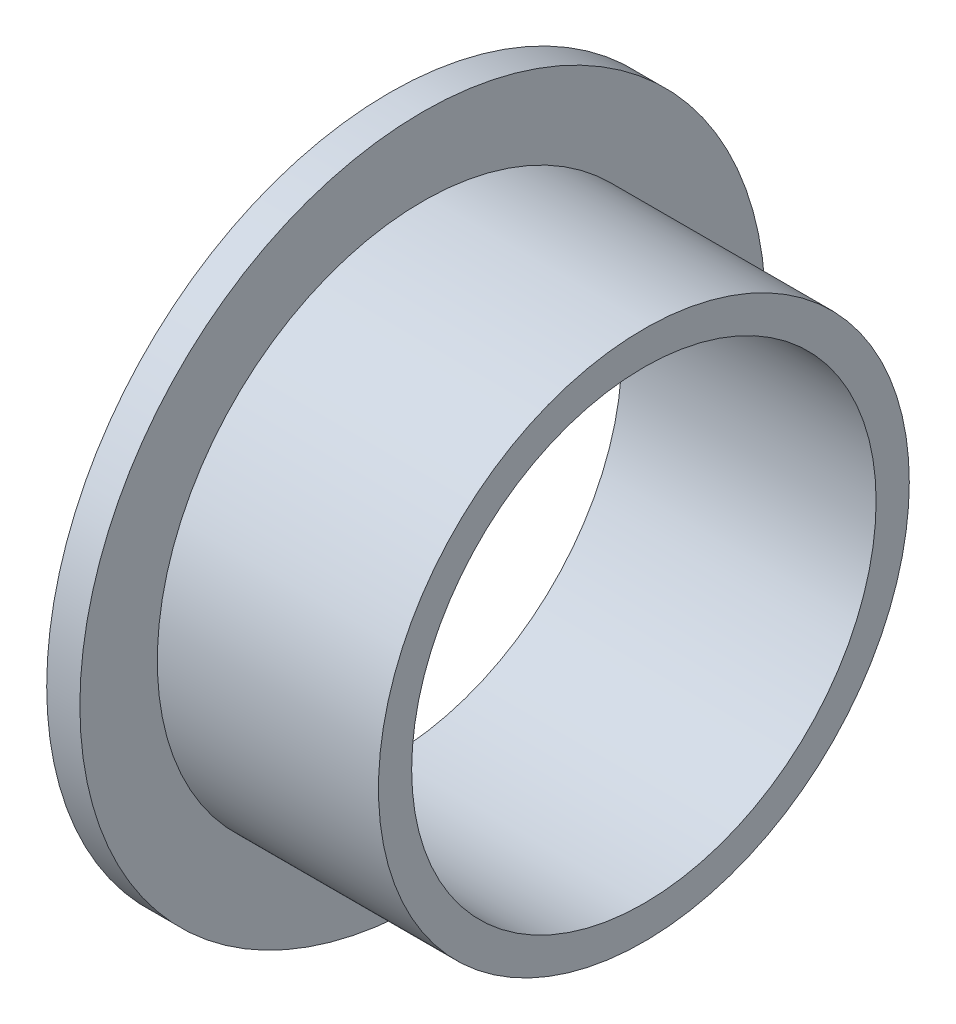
ISO-10303-21;
HEADER;
FILE_DESCRIPTION(('STEP AP214'),'2;1');
FILE_NAME('part.step','',(''),(''),'','','');
FILE_SCHEMA(('AUTOMOTIVE_DESIGN { 1 0 10303 214 1 1 1 1 }'));
ENDSEC;
DATA;
#1=APPLICATION_CONTEXT('core data for automotive mechanical design processes');
#2=APPLICATION_PROTOCOL_DEFINITION('international standard','automotive_design',2000,#1);
#3=PRODUCT_CONTEXT('',#1,'mechanical');
#4=PRODUCT('Part','Part','',(#3));
#5=PRODUCT_RELATED_PRODUCT_CATEGORY('part','',(#4));
#6=PRODUCT_DEFINITION_FORMATION('','',#4);
#7=PRODUCT_DEFINITION_CONTEXT('part definition',#1,'design');
#8=PRODUCT_DEFINITION('design','',#6,#7);
#9=PRODUCT_DEFINITION_SHAPE('','',#8);
#10=(LENGTH_UNIT() NAMED_UNIT(*) SI_UNIT(.MILLI.,.METRE.));
#11=(NAMED_UNIT(*) PLANE_ANGLE_UNIT() SI_UNIT($,.RADIAN.));
#12=(NAMED_UNIT(*) SI_UNIT($,.STERADIAN.) SOLID_ANGLE_UNIT());
#13=UNCERTAINTY_MEASURE_WITH_UNIT(LENGTH_MEASURE(1.E-05),#10,'distance_accuracy_value','');
#14=(GEOMETRIC_REPRESENTATION_CONTEXT(3) GLOBAL_UNCERTAINTY_ASSIGNED_CONTEXT((#13)) GLOBAL_UNIT_ASSIGNED_CONTEXT((#10,
#11,#12)) REPRESENTATION_CONTEXT('',''));
#15=CARTESIAN_POINT('',(0.,0.,0.));
#16=DIRECTION('',(0.,0.,1.));
#17=DIRECTION('',(1.,0.,0.));
#18=AXIS2_PLACEMENT_3D('',#15,#16,#17);
#19=CARTESIAN_POINT('',(-46.,42.,0.));
#20=DIRECTION('',(-1.,0.,0.));
#21=DIRECTION('',(0.,0.,1.));
#22=AXIS2_PLACEMENT_3D('',#19,#20,#21);
#23=PLANE('',#22);
#24=CARTESIAN_POINT('',(-46.,0.,0.));
#25=DIRECTION('',(1.,0.,0.));
#26=DIRECTION('',(0.,0.,-1.));
#27=AXIS2_PLACEMENT_3D('',#24,#25,#26);
#28=CIRCLE('',#27,42.);
#29=CARTESIAN_POINT('',(-46.,0.,-42.));
#30=VERTEX_POINT('',#29);
#31=EDGE_CURVE('E52',#30,#30,#28,.T.);
#32=ORIENTED_EDGE('',*,*,#31,.T.);
#33=EDGE_LOOP('',(#32));
#34=FACE_BOUND('',#33,.T.);
#35=CARTESIAN_POINT('',(-46.,0.,0.));
#36=DIRECTION('',(1.,0.,0.));
#37=DIRECTION('',(0.,0.,-1.));
#38=AXIS2_PLACEMENT_3D('',#35,#36,#37);
#39=CIRCLE('',#38,62.);
#40=CARTESIAN_POINT('',(-46.,0.,-62.));
#41=VERTEX_POINT('',#40);
#42=EDGE_CURVE('E10',#41,#41,#39,.T.);
#43=ORIENTED_EDGE('',*,*,#42,.F.);
#44=EDGE_LOOP('',(#43));
#45=FACE_BOUND('',#44,.T.);
#46=ADVANCED_FACE('F30',(#34,#45),#23,.T.);
#47=CARTESIAN_POINT('',(0.,0.,0.));
#48=DIRECTION('',(1.,0.,0.));
#49=DIRECTION('',(0.,0.,-1.));
#50=AXIS2_PLACEMENT_3D('',#47,#48,#49);
#51=CYLINDRICAL_SURFACE('',#50,62.);
#52=ORIENTED_EDGE('',*,*,#42,.T.);
#53=EDGE_LOOP('',(#52));
#54=FACE_BOUND('',#53,.T.);
#55=CARTESIAN_POINT('',(-40.,0.,0.));
#56=DIRECTION('',(1.,0.,0.));
#57=DIRECTION('',(0.,0.,-1.));
#58=AXIS2_PLACEMENT_3D('',#55,#56,#57);
#59=CIRCLE('',#58,62.);
#60=CARTESIAN_POINT('',(-40.,0.,-62.));
#61=VERTEX_POINT('',#60);
#62=EDGE_CURVE('E36',#61,#61,#59,.T.);
#63=ORIENTED_EDGE('',*,*,#62,.F.);
#64=EDGE_LOOP('',(#63));
#65=FACE_BOUND('',#64,.T.);
#66=ADVANCED_FACE('F70',(#54,#65),#51,.T.);
#67=CARTESIAN_POINT('',(-40.,62.,0.));
#68=DIRECTION('',(1.,0.,0.));
#69=DIRECTION('',(0.,0.,-1.));
#70=AXIS2_PLACEMENT_3D('',#67,#68,#69);
#71=PLANE('',#70);
#72=ORIENTED_EDGE('',*,*,#62,.T.);
#73=EDGE_LOOP('',(#72));
#74=FACE_BOUND('',#73,.T.);
#75=CARTESIAN_POINT('',(-40.,0.,0.));
#76=DIRECTION('',(1.,0.,0.));
#77=DIRECTION('',(0.,0.,-1.));
#78=AXIS2_PLACEMENT_3D('',#75,#76,#77);
#79=CIRCLE('',#78,48.);
#80=CARTESIAN_POINT('',(-40.,0.,-48.));
#81=VERTEX_POINT('',#80);
#82=EDGE_CURVE('E40',#81,#81,#79,.T.);
#83=ORIENTED_EDGE('',*,*,#82,.F.);
#84=EDGE_LOOP('',(#83));
#85=FACE_BOUND('',#84,.T.);
#86=ADVANCED_FACE('F74',(#74,#85),#71,.T.);
#87=CARTESIAN_POINT('',(0.,0.,0.));
#88=DIRECTION('',(1.,0.,0.));
#89=DIRECTION('',(0.,0.,-1.));
#90=AXIS2_PLACEMENT_3D('',#87,#88,#89);
#91=CYLINDRICAL_SURFACE('',#90,48.);
#92=ORIENTED_EDGE('',*,*,#82,.T.);
#93=EDGE_LOOP('',(#92));
#94=FACE_BOUND('',#93,.T.);
#95=CARTESIAN_POINT('',(0.,0.,0.));
#96=DIRECTION('',(1.,0.,0.));
#97=DIRECTION('',(0.,0.,-1.));
#98=AXIS2_PLACEMENT_3D('',#95,#96,#97);
#99=CIRCLE('',#98,48.);
#100=CARTESIAN_POINT('',(0.,0.,-48.));
#101=VERTEX_POINT('',#100);
#102=EDGE_CURVE('E44',#101,#101,#99,.T.);
#103=ORIENTED_EDGE('',*,*,#102,.F.);
#104=EDGE_LOOP('',(#103));
#105=FACE_BOUND('',#104,.T.);
#106=ADVANCED_FACE('F66',(#94,#105),#91,.T.);
#107=CARTESIAN_POINT('',(0.,48.,0.));
#108=DIRECTION('',(1.,0.,0.));
#109=DIRECTION('',(0.,0.,-1.));
#110=AXIS2_PLACEMENT_3D('',#107,#108,#109);
#111=PLANE('',#110);
#112=ORIENTED_EDGE('',*,*,#102,.T.);
#113=EDGE_LOOP('',(#112));
#114=FACE_BOUND('',#113,.T.);
#115=CARTESIAN_POINT('',(0.,0.,0.));
#116=DIRECTION('',(1.,0.,0.));
#117=DIRECTION('',(0.,0.,-1.));
#118=AXIS2_PLACEMENT_3D('',#115,#116,#117);
#119=CIRCLE('',#118,42.);
#120=CARTESIAN_POINT('',(0.,0.,-42.));
#121=VERTEX_POINT('',#120);
#122=EDGE_CURVE('E49',#121,#121,#119,.T.);
#123=ORIENTED_EDGE('',*,*,#122,.F.);
#124=EDGE_LOOP('',(#123));
#125=FACE_BOUND('',#124,.T.);
#126=ADVANCED_FACE('F60',(#114,#125),#111,.T.);
#127=CARTESIAN_POINT('',(0.,0.,0.));
#128=DIRECTION('',(1.,0.,0.));
#129=DIRECTION('',(0.,0.,-1.));
#130=AXIS2_PLACEMENT_3D('',#127,#128,#129);
#131=CYLINDRICAL_SURFACE('',#130,42.);
#132=ORIENTED_EDGE('',*,*,#122,.T.);
#133=EDGE_LOOP('',(#132));
#134=FACE_BOUND('',#133,.T.);
#135=ORIENTED_EDGE('',*,*,#31,.F.);
#136=EDGE_LOOP('',(#135));
#137=FACE_BOUND('',#136,.T.);
#138=ADVANCED_FACE('F58',(#134,#137),#131,.F.);
#139=CLOSED_SHELL('',(#46,#66,#86,#106,#126,#138));
#140=MANIFOLD_SOLID_BREP('B2',#139);
#141=ADVANCED_BREP_SHAPE_REPRESENTATION('',(#18,#140),#14);
#142=SHAPE_DEFINITION_REPRESENTATION(#9,#141);
ENDSEC;
END-ISO-10303-21;
